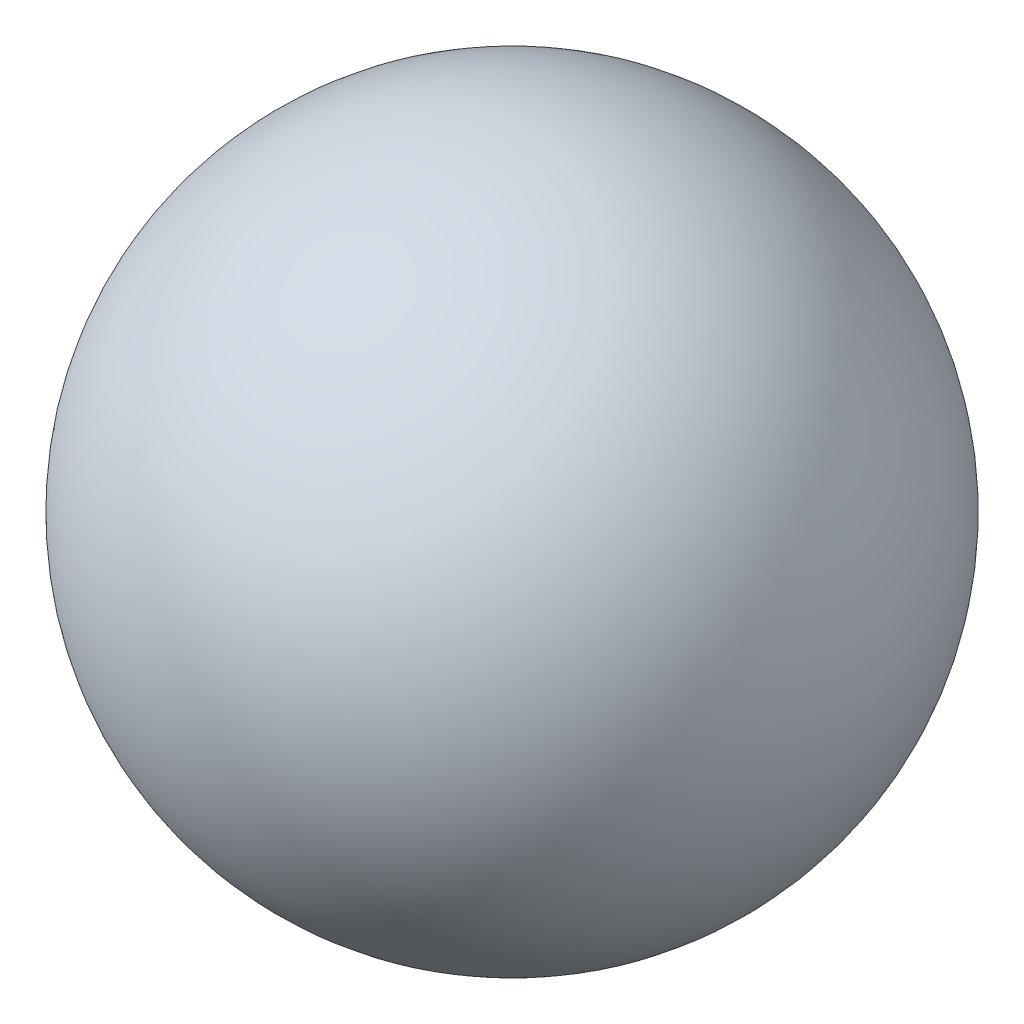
ISO-10303-21;
HEADER;
FILE_DESCRIPTION(('STEP AP214'),'2;1');
FILE_NAME('part.step','',(''),(''),'','','');
FILE_SCHEMA(('AUTOMOTIVE_DESIGN { 1 0 10303 214 1 1 1 1 }'));
ENDSEC;
DATA;
#1=APPLICATION_CONTEXT('core data for automotive mechanical design processes');
#2=APPLICATION_PROTOCOL_DEFINITION('international standard','automotive_design',2000,#1);
#3=PRODUCT_CONTEXT('',#1,'mechanical');
#4=PRODUCT('Part','Part','',(#3));
#5=PRODUCT_RELATED_PRODUCT_CATEGORY('part','',(#4));
#6=PRODUCT_DEFINITION_FORMATION('','',#4);
#7=PRODUCT_DEFINITION_CONTEXT('part definition',#1,'design');
#8=PRODUCT_DEFINITION('design','',#6,#7);
#9=PRODUCT_DEFINITION_SHAPE('','',#8);
#10=(LENGTH_UNIT() NAMED_UNIT(*) SI_UNIT(.MILLI.,.METRE.));
#11=(NAMED_UNIT(*) PLANE_ANGLE_UNIT() SI_UNIT($,.RADIAN.));
#12=(NAMED_UNIT(*) SI_UNIT($,.STERADIAN.) SOLID_ANGLE_UNIT());
#13=UNCERTAINTY_MEASURE_WITH_UNIT(LENGTH_MEASURE(1.E-05),#10,'distance_accuracy_value','');
#14=(GEOMETRIC_REPRESENTATION_CONTEXT(3) GLOBAL_UNCERTAINTY_ASSIGNED_CONTEXT((#13)) GLOBAL_UNIT_ASSIGNED_CONTEXT((#10,
#11,#12)) REPRESENTATION_CONTEXT('',''));
#15=CARTESIAN_POINT('',(0.,0.,0.));
#16=DIRECTION('',(0.,0.,1.));
#17=DIRECTION('',(1.,0.,0.));
#18=AXIS2_PLACEMENT_3D('',#15,#16,#17);
#19=CARTESIAN_POINT('',(0.,0.,0.));
#20=DIRECTION('',(0.,1.,0.));
#21=DIRECTION('',(1.,0.,0.));
#22=AXIS2_PLACEMENT_3D('',#19,#20,#21);
#23=SPHERICAL_SURFACE('',#22,13.5);
#24=CARTESIAN_POINT('',(0.,13.5,0.));
#25=VERTEX_POINT('',#24);
#26=VERTEX_LOOP('',#25);
#27=FACE_BOUND('',#26,.T.);
#28=ADVANCED_FACE('F27',(#27),#23,.T.);
#29=CLOSED_SHELL('',(#28));
#30=MANIFOLD_SOLID_BREP('B2',#29);
#31=ADVANCED_BREP_SHAPE_REPRESENTATION('',(#18,#30),#14);
#32=SHAPE_DEFINITION_REPRESENTATION(#9,#31);
ENDSEC;
END-ISO-10303-21;
